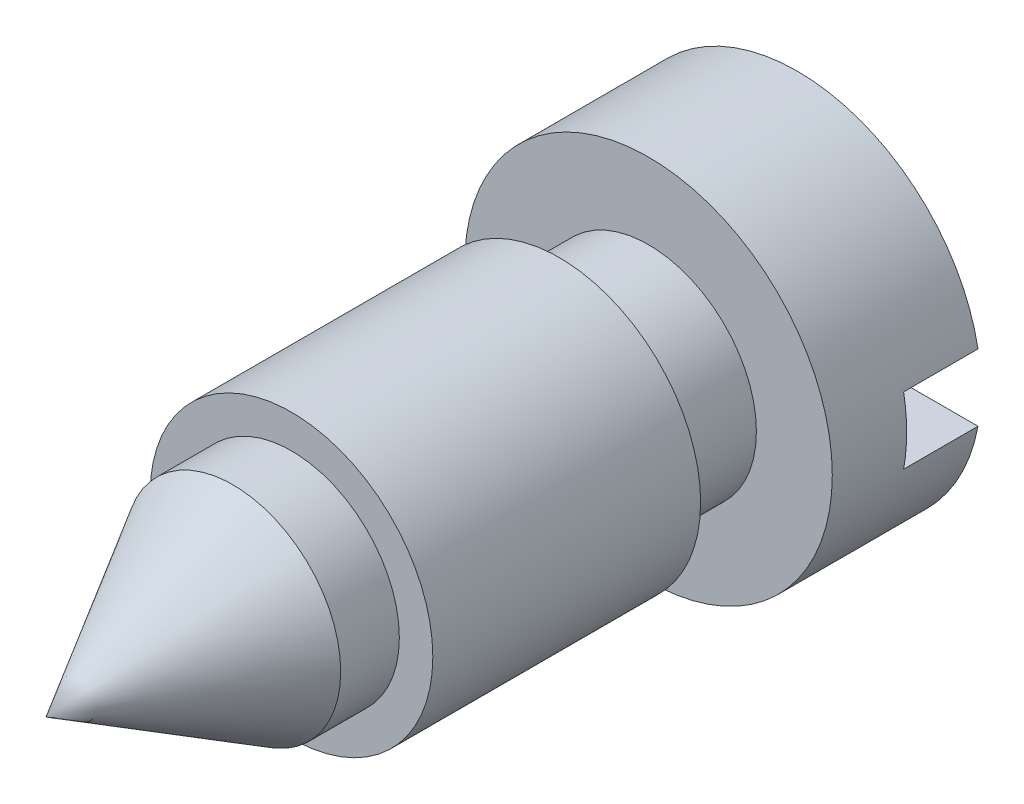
ISO-10303-21;
HEADER;
FILE_DESCRIPTION(('STEP AP214'),'2;1');
FILE_NAME('part.step','',(''),(''),'','','');
FILE_SCHEMA(('AUTOMOTIVE_DESIGN { 1 0 10303 214 1 1 1 1 }'));
ENDSEC;
DATA;
#1=APPLICATION_CONTEXT('core data for automotive mechanical design processes');
#2=APPLICATION_PROTOCOL_DEFINITION('international standard','automotive_design',2000,#1);
#3=PRODUCT_CONTEXT('',#1,'mechanical');
#4=PRODUCT('Part','Part','',(#3));
#5=PRODUCT_RELATED_PRODUCT_CATEGORY('part','',(#4));
#6=PRODUCT_DEFINITION_FORMATION('','',#4);
#7=PRODUCT_DEFINITION_CONTEXT('part definition',#1,'design');
#8=PRODUCT_DEFINITION('design','',#6,#7);
#9=PRODUCT_DEFINITION_SHAPE('','',#8);
#10=(LENGTH_UNIT() NAMED_UNIT(*) SI_UNIT(.MILLI.,.METRE.));
#11=(NAMED_UNIT(*) PLANE_ANGLE_UNIT() SI_UNIT($,.RADIAN.));
#12=(NAMED_UNIT(*) SI_UNIT($,.STERADIAN.) SOLID_ANGLE_UNIT());
#13=UNCERTAINTY_MEASURE_WITH_UNIT(LENGTH_MEASURE(1.E-05),#10,'distance_accuracy_value','');
#14=(GEOMETRIC_REPRESENTATION_CONTEXT(3) GLOBAL_UNCERTAINTY_ASSIGNED_CONTEXT((#13)) GLOBAL_UNIT_ASSIGNED_CONTEXT((#10,
#11,#12)) REPRESENTATION_CONTEXT('',''));
#15=CARTESIAN_POINT('',(0.,0.,0.));
#16=DIRECTION('',(0.,0.,1.));
#17=DIRECTION('',(1.,0.,0.));
#18=AXIS2_PLACEMENT_3D('',#15,#16,#17);
#19=CARTESIAN_POINT('',(0.,0.,0.));
#20=DIRECTION('',(0.,0.,1.));
#21=DIRECTION('',(1.,0.,0.));
#22=AXIS2_PLACEMENT_3D('',#19,#20,#21);
#23=PLANE('',#22);
#24=CARTESIAN_POINT('',(0.,0.,0.));
#25=DIRECTION('',(0.,0.,1.));
#26=DIRECTION('',(1.,0.,0.));
#27=AXIS2_PLACEMENT_3D('',#24,#25,#26);
#28=CIRCLE('',#27,3.1369);
#29=CARTESIAN_POINT('',(-3.08440097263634,-0.5715,0.));
#30=VERTEX_POINT('',#29);
#31=CARTESIAN_POINT('',(3.08440097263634,-0.5715,0.));
#32=VERTEX_POINT('',#31);
#33=EDGE_CURVE('E90',#30,#32,#28,.T.);
#34=ORIENTED_EDGE('',*,*,#33,.F.);
#35=DIRECTION('',(1.,0.,0.));
#36=VECTOR('',#35,1.);
#37=CARTESIAN_POINT('',(-3.81,-0.5715,0.));
#38=LINE('',#37,#36);
#39=EDGE_CURVE('E106',#30,#32,#38,.T.);
#40=ORIENTED_EDGE('',*,*,#39,.T.);
#41=EDGE_LOOP('',(#34,#40));
#42=FACE_BOUND('',#41,.T.);
#43=ADVANCED_FACE('F35',(#42),#23,.F.);
#44=CARTESIAN_POINT('',(3.08440097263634,0.571499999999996,0.));
#45=VERTEX_POINT('',#44);
#46=CARTESIAN_POINT('',(-3.08440097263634,0.5715,0.));
#47=VERTEX_POINT('',#46);
#48=EDGE_CURVE('E85',#45,#47,#28,.T.);
#49=ORIENTED_EDGE('',*,*,#48,.F.);
#50=DIRECTION('',(1.,0.,0.));
#51=VECTOR('',#50,1.);
#52=CARTESIAN_POINT('',(-3.81,0.5715,0.));
#53=LINE('',#52,#51);
#54=EDGE_CURVE('E50',#47,#45,#53,.T.);
#55=ORIENTED_EDGE('',*,*,#54,.F.);
#56=EDGE_LOOP('',(#49,#55));
#57=FACE_BOUND('',#56,.T.);
#58=ADVANCED_FACE('F37',(#57),#23,.F.);
#59=CARTESIAN_POINT('',(0.,0.,50.5022865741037));
#60=DIRECTION('',(0.,0.,1.));
#61=DIRECTION('',(1.,0.,0.));
#62=AXIS2_PLACEMENT_3D('',#59,#60,#61);
#63=CYLINDRICAL_SURFACE('',#62,3.1369);
#64=CARTESIAN_POINT('',(0.,0.,2.54));
#65=DIRECTION('',(0.,0.,1.));
#66=DIRECTION('',(1.,0.,0.));
#67=AXIS2_PLACEMENT_3D('',#64,#65,#66);
#68=CIRCLE('',#67,3.1369);
#69=CARTESIAN_POINT('',(3.1369,0.,2.54));
#70=VERTEX_POINT('',#69);
#71=EDGE_CURVE('E95',#70,#70,#68,.T.);
#72=ORIENTED_EDGE('',*,*,#71,.F.);
#73=EDGE_LOOP('',(#72));
#74=FACE_BOUND('',#73,.T.);
#75=CARTESIAN_POINT('',(0.,0.,1.27));
#76=DIRECTION('',(0.,0.,1.));
#77=DIRECTION('',(1.,0.,0.));
#78=AXIS2_PLACEMENT_3D('',#75,#76,#77);
#79=CIRCLE('',#78,3.1369);
#80=CARTESIAN_POINT('',(-3.08440097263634,0.5715,1.27));
#81=VERTEX_POINT('',#80);
#82=CARTESIAN_POINT('',(-3.08440097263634,-0.5715,1.27));
#83=VERTEX_POINT('',#82);
#84=EDGE_CURVE('E43',#81,#83,#79,.T.);
#85=ORIENTED_EDGE('',*,*,#84,.T.);
#86=DIRECTION('',(0.,0.,1.));
#87=VECTOR('',#86,1.);
#88=CARTESIAN_POINT('',(-3.08440097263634,-0.571499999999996,50.5022865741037));
#89=LINE('',#88,#87);
#90=EDGE_CURVE('E11',#83,#30,#89,.F.);
#91=ORIENTED_EDGE('',*,*,#90,.T.);
#92=ORIENTED_EDGE('',*,*,#33,.T.);
#93=DIRECTION('',(0.,0.,1.));
#94=VECTOR('',#93,1.);
#95=CARTESIAN_POINT('',(3.08440097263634,-0.571499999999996,50.5022865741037));
#96=LINE('',#95,#94);
#97=CARTESIAN_POINT('',(3.08440097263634,-0.5715,1.27));
#98=VERTEX_POINT('',#97);
#99=EDGE_CURVE('E82',#32,#98,#96,.T.);
#100=ORIENTED_EDGE('',*,*,#99,.T.);
#101=CARTESIAN_POINT('',(3.08440097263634,0.5715,1.27));
#102=VERTEX_POINT('',#101);
#103=EDGE_CURVE('E92',#98,#102,#79,.T.);
#104=ORIENTED_EDGE('',*,*,#103,.T.);
#105=DIRECTION('',(0.,0.,1.));
#106=VECTOR('',#105,1.);
#107=CARTESIAN_POINT('',(3.08440097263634,0.571499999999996,50.5022865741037));
#108=LINE('',#107,#106);
#109=EDGE_CURVE('E89',#102,#45,#108,.F.);
#110=ORIENTED_EDGE('',*,*,#109,.T.);
#111=ORIENTED_EDGE('',*,*,#48,.T.);
#112=DIRECTION('',(0.,0.,1.));
#113=VECTOR('',#112,1.);
#114=CARTESIAN_POINT('',(-3.08440097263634,0.571499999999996,50.5022865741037));
#115=LINE('',#114,#113);
#116=EDGE_CURVE('E75',#47,#81,#115,.T.);
#117=ORIENTED_EDGE('',*,*,#116,.T.);
#118=EDGE_LOOP('',(#85,#91,#92,#100,#104,#110,#111,#117));
#119=FACE_BOUND('',#118,.T.);
#120=ADVANCED_FACE('F87',(#74,#119),#63,.T.);
#121=CARTESIAN_POINT('',(0.,3.1369,2.54));
#122=DIRECTION('',(0.,0.,-1.));
#123=DIRECTION('',(-1.,0.,0.));
#124=AXIS2_PLACEMENT_3D('',#121,#122,#123);
#125=PLANE('',#124);
#126=CARTESIAN_POINT('',(0.,0.,2.54));
#127=DIRECTION('',(0.,0.,1.));
#128=DIRECTION('',(1.,0.,0.));
#129=AXIS2_PLACEMENT_3D('',#126,#127,#128);
#130=CIRCLE('',#129,1.8415);
#131=CARTESIAN_POINT('',(1.8415,0.,2.54));
#132=VERTEX_POINT('',#131);
#133=EDGE_CURVE('E128',#132,#132,#130,.T.);
#134=ORIENTED_EDGE('',*,*,#133,.F.);
#135=EDGE_LOOP('',(#134));
#136=FACE_BOUND('',#135,.T.);
#137=ORIENTED_EDGE('',*,*,#71,.T.);
#138=EDGE_LOOP('',(#137));
#139=FACE_BOUND('',#138,.T.);
#140=ADVANCED_FACE('F135',(#136,#139),#125,.F.);
#141=CARTESIAN_POINT('',(0.,0.,50.5022865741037));
#142=DIRECTION('',(0.,0.,1.));
#143=DIRECTION('',(1.,0.,0.));
#144=AXIS2_PLACEMENT_3D('',#141,#142,#143);
#145=CYLINDRICAL_SURFACE('',#144,1.8415);
#146=CARTESIAN_POINT('',(0.,0.,4.064));
#147=DIRECTION('',(0.,0.,1.));
#148=DIRECTION('',(1.,0.,0.));
#149=AXIS2_PLACEMENT_3D('',#146,#147,#148);
#150=CIRCLE('',#149,1.8415);
#151=CARTESIAN_POINT('',(1.8415,0.,4.064));
#152=VERTEX_POINT('',#151);
#153=EDGE_CURVE('E126',#152,#152,#150,.T.);
#154=ORIENTED_EDGE('',*,*,#153,.F.);
#155=EDGE_LOOP('',(#154));
#156=FACE_BOUND('',#155,.T.);
#157=ORIENTED_EDGE('',*,*,#133,.T.);
#158=EDGE_LOOP('',(#157));
#159=FACE_BOUND('',#158,.T.);
#160=ADVANCED_FACE('F142',(#156,#159),#145,.T.);
#161=CARTESIAN_POINT('',(0.,1.8415,4.064));
#162=DIRECTION('',(0.,0.,1.));
#163=DIRECTION('',(1.,0.,0.));
#164=AXIS2_PLACEMENT_3D('',#161,#162,#163);
#165=PLANE('',#164);
#166=CARTESIAN_POINT('',(0.,0.,4.064));
#167=DIRECTION('',(0.,0.,1.));
#168=DIRECTION('',(1.,0.,0.));
#169=AXIS2_PLACEMENT_3D('',#166,#167,#168);
#170=CIRCLE('',#169,2.413);
#171=CARTESIAN_POINT('',(2.413,0.,4.064));
#172=VERTEX_POINT('',#171);
#173=EDGE_CURVE('E123',#172,#172,#170,.T.);
#174=ORIENTED_EDGE('',*,*,#173,.F.);
#175=EDGE_LOOP('',(#174));
#176=FACE_BOUND('',#175,.T.);
#177=ORIENTED_EDGE('',*,*,#153,.T.);
#178=EDGE_LOOP('',(#177));
#179=FACE_BOUND('',#178,.T.);
#180=ADVANCED_FACE('F203',(#176,#179),#165,.F.);
#181=CARTESIAN_POINT('',(0.,0.,50.5022865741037));
#182=DIRECTION('',(0.,0.,1.));
#183=DIRECTION('',(1.,0.,0.));
#184=AXIS2_PLACEMENT_3D('',#181,#182,#183);
#185=CYLINDRICAL_SURFACE('',#184,2.413);
#186=CARTESIAN_POINT('',(0.,0.,8.636));
#187=DIRECTION('',(0.,0.,1.));
#188=DIRECTION('',(1.,0.,0.));
#189=AXIS2_PLACEMENT_3D('',#186,#187,#188);
#190=CIRCLE('',#189,2.413);
#191=CARTESIAN_POINT('',(2.413,0.,8.636));
#192=VERTEX_POINT('',#191);
#193=EDGE_CURVE('E120',#192,#192,#190,.T.);
#194=ORIENTED_EDGE('',*,*,#193,.F.);
#195=EDGE_LOOP('',(#194));
#196=FACE_BOUND('',#195,.T.);
#197=ORIENTED_EDGE('',*,*,#173,.T.);
#198=EDGE_LOOP('',(#197));
#199=FACE_BOUND('',#198,.T.);
#200=ADVANCED_FACE('F199',(#196,#199),#185,.T.);
#201=CARTESIAN_POINT('',(0.,2.413,8.636));
#202=DIRECTION('',(0.,0.,-1.));
#203=DIRECTION('',(-1.,0.,0.));
#204=AXIS2_PLACEMENT_3D('',#201,#202,#203);
#205=PLANE('',#204);
#206=CARTESIAN_POINT('',(0.,0.,8.636));
#207=DIRECTION('',(0.,0.,1.));
#208=DIRECTION('',(1.,0.,0.));
#209=AXIS2_PLACEMENT_3D('',#206,#207,#208);
#210=CIRCLE('',#209,1.8415);
#211=CARTESIAN_POINT('',(1.8415,0.,8.636));
#212=VERTEX_POINT('',#211);
#213=EDGE_CURVE('E113',#212,#212,#210,.T.);
#214=ORIENTED_EDGE('',*,*,#213,.F.);
#215=EDGE_LOOP('',(#214));
#216=FACE_BOUND('',#215,.T.);
#217=ORIENTED_EDGE('',*,*,#193,.T.);
#218=EDGE_LOOP('',(#217));
#219=FACE_BOUND('',#218,.T.);
#220=ADVANCED_FACE('F195',(#216,#219),#205,.F.);
#221=CARTESIAN_POINT('',(0.,0.,50.5022865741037));
#222=DIRECTION('',(0.,0.,1.));
#223=DIRECTION('',(1.,0.,0.));
#224=AXIS2_PLACEMENT_3D('',#221,#222,#223);
#225=CYLINDRICAL_SURFACE('',#224,1.8415);
#226=CARTESIAN_POINT('',(0.,0.,9.63742843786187));
#227=DIRECTION('',(0.,0.,1.));
#228=DIRECTION('',(1.,0.,0.));
#229=AXIS2_PLACEMENT_3D('',#226,#227,#228);
#230=CIRCLE('',#229,1.8415);
#231=CARTESIAN_POINT('',(1.8415,0.,9.63742843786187));
#232=VERTEX_POINT('',#231);
#233=EDGE_CURVE('E110',#232,#232,#230,.T.);
#234=ORIENTED_EDGE('',*,*,#233,.F.);
#235=EDGE_LOOP('',(#234));
#236=FACE_BOUND('',#235,.T.);
#237=ORIENTED_EDGE('',*,*,#213,.T.);
#238=EDGE_LOOP('',(#237));
#239=FACE_BOUND('',#238,.T.);
#240=ADVANCED_FACE('F192',(#236,#239),#225,.T.);
#241=CARTESIAN_POINT('',(0.,0.,9.63742843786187));
#242=DIRECTION('',(0.,0.,-1.));
#243=DIRECTION('',(-1.,0.,0.));
#244=AXIS2_PLACEMENT_3D('',#241,#242,#243);
#245=CONICAL_SURFACE('',#244,1.8415,0.523598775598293);
#246=CARTESIAN_POINT('',(0.,0.,12.827));
#247=VERTEX_POINT('',#246);
#248=VERTEX_LOOP('',#247);
#249=FACE_BOUND('',#248,.T.);
#250=ORIENTED_EDGE('',*,*,#233,.T.);
#251=EDGE_LOOP('',(#250));
#252=FACE_BOUND('',#251,.T.);
#253=ADVANCED_FACE('F168',(#249,#252),#245,.T.);
#254=CARTESIAN_POINT('',(-3.81,-0.5715,0.));
#255=DIRECTION('',(0.,-1.,0.));
#256=DIRECTION('',(0.,0.,-1.));
#257=AXIS2_PLACEMENT_3D('',#254,#255,#256);
#258=PLANE('',#257);
#259=ORIENTED_EDGE('',*,*,#39,.F.);
#260=ORIENTED_EDGE('',*,*,#90,.F.);
#261=DIRECTION('',(1.,0.,0.));
#262=VECTOR('',#261,1.);
#263=CARTESIAN_POINT('',(-3.81,-0.5715,1.27));
#264=LINE('',#263,#262);
#265=EDGE_CURVE('E108',#83,#98,#264,.T.);
#266=ORIENTED_EDGE('',*,*,#265,.T.);
#267=ORIENTED_EDGE('',*,*,#99,.F.);
#268=EDGE_LOOP('',(#259,#260,#266,#267));
#269=FACE_BOUND('',#268,.T.);
#270=ADVANCED_FACE('F105',(#269),#258,.F.);
#271=CARTESIAN_POINT('',(-3.81,0.5715,1.27));
#272=DIRECTION('',(0.,0.,1.));
#273=DIRECTION('',(1.,0.,0.));
#274=AXIS2_PLACEMENT_3D('',#271,#272,#273);
#275=PLANE('',#274);
#276=DIRECTION('',(1.,0.,0.));
#277=VECTOR('',#276,1.);
#278=CARTESIAN_POINT('',(-3.81,0.5715,1.27));
#279=LINE('',#278,#277);
#280=EDGE_CURVE('E78',#81,#102,#279,.T.);
#281=ORIENTED_EDGE('',*,*,#280,.T.);
#282=ORIENTED_EDGE('',*,*,#103,.F.);
#283=ORIENTED_EDGE('',*,*,#265,.F.);
#284=ORIENTED_EDGE('',*,*,#84,.F.);
#285=EDGE_LOOP('',(#281,#282,#283,#284));
#286=FACE_BOUND('',#285,.T.);
#287=ADVANCED_FACE('F167',(#286),#275,.F.);
#288=CARTESIAN_POINT('',(-3.81,0.5715,0.));
#289=DIRECTION('',(0.,1.,0.));
#290=DIRECTION('',(0.,0.,1.));
#291=AXIS2_PLACEMENT_3D('',#288,#289,#290);
#292=PLANE('',#291);
#293=ORIENTED_EDGE('',*,*,#54,.T.);
#294=ORIENTED_EDGE('',*,*,#109,.F.);
#295=ORIENTED_EDGE('',*,*,#280,.F.);
#296=ORIENTED_EDGE('',*,*,#116,.F.);
#297=EDGE_LOOP('',(#293,#294,#295,#296));
#298=FACE_BOUND('',#297,.T.);
#299=ADVANCED_FACE('F76',(#298),#292,.F.);
#300=CLOSED_SHELL('',(#43,#58,#120,#140,#160,#180,#200,#220,#240,#253,#270,#287,#299));
#301=MANIFOLD_SOLID_BREP('B2',#300);
#302=ADVANCED_BREP_SHAPE_REPRESENTATION('',(#18,#301),#14);
#303=SHAPE_DEFINITION_REPRESENTATION(#9,#302);
ENDSEC;
END-ISO-10303-21;
